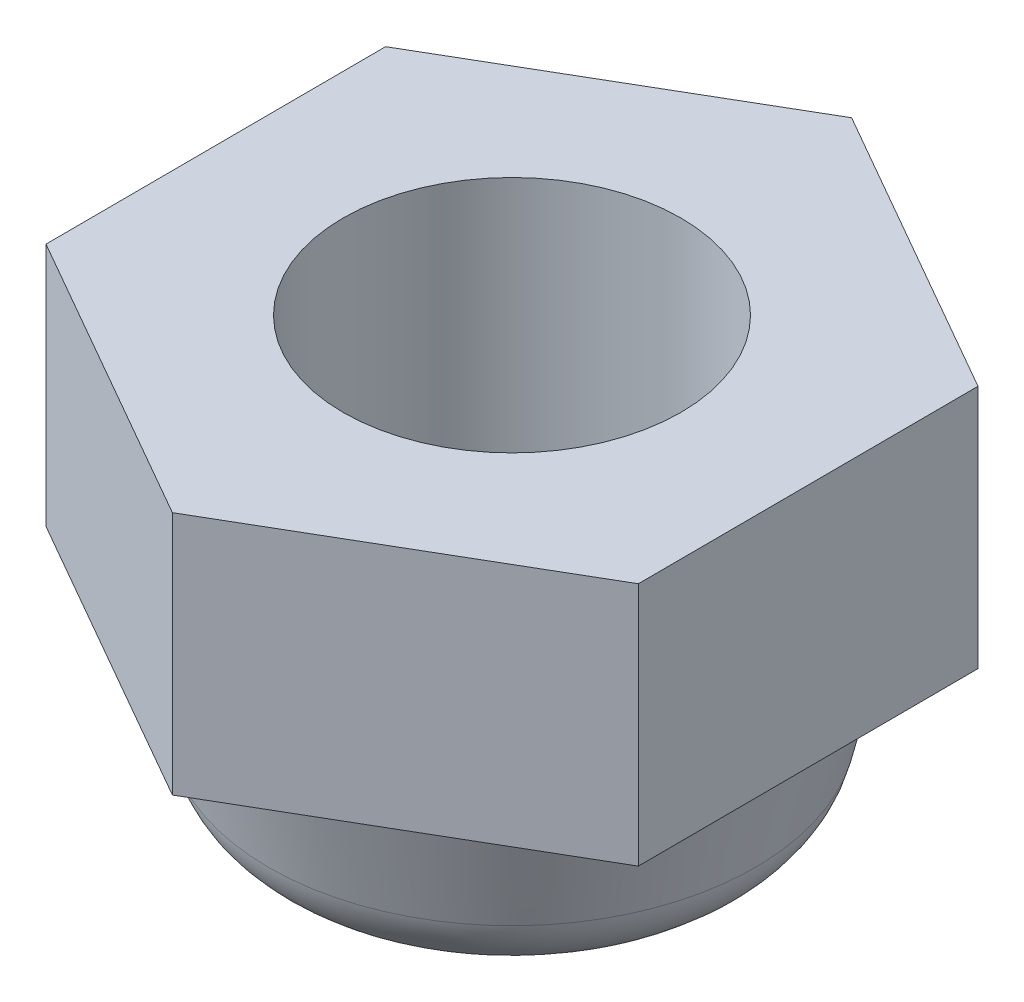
ISO-10303-21;
HEADER;
FILE_DESCRIPTION(('STEP AP214'),'2;1');
FILE_NAME('part.step','',(''),(''),'','','');
FILE_SCHEMA(('AUTOMOTIVE_DESIGN { 1 0 10303 214 1 1 1 1 }'));
ENDSEC;
DATA;
#1=APPLICATION_CONTEXT('core data for automotive mechanical design processes');
#2=APPLICATION_PROTOCOL_DEFINITION('international standard','automotive_design',2000,#1);
#3=PRODUCT_CONTEXT('',#1,'mechanical');
#4=PRODUCT('Part','Part','',(#3));
#5=PRODUCT_RELATED_PRODUCT_CATEGORY('part','',(#4));
#6=PRODUCT_DEFINITION_FORMATION('','',#4);
#7=PRODUCT_DEFINITION_CONTEXT('part definition',#1,'design');
#8=PRODUCT_DEFINITION('design','',#6,#7);
#9=PRODUCT_DEFINITION_SHAPE('','',#8);
#10=(LENGTH_UNIT() NAMED_UNIT(*) SI_UNIT(.MILLI.,.METRE.));
#11=(NAMED_UNIT(*) PLANE_ANGLE_UNIT() SI_UNIT($,.RADIAN.));
#12=(NAMED_UNIT(*) SI_UNIT($,.STERADIAN.) SOLID_ANGLE_UNIT());
#13=UNCERTAINTY_MEASURE_WITH_UNIT(LENGTH_MEASURE(1.E-05),#10,'distance_accuracy_value','');
#14=(GEOMETRIC_REPRESENTATION_CONTEXT(3) GLOBAL_UNCERTAINTY_ASSIGNED_CONTEXT((#13)) GLOBAL_UNIT_ASSIGNED_CONTEXT((#10,
#11,#12)) REPRESENTATION_CONTEXT('',''));
#15=CARTESIAN_POINT('',(0.,0.,0.));
#16=DIRECTION('',(0.,0.,1.));
#17=DIRECTION('',(1.,0.,0.));
#18=AXIS2_PLACEMENT_3D('',#15,#16,#17);
#19=CARTESIAN_POINT('',(3.49279421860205,0.,-2.03315564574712));
#20=DIRECTION('',(0.,1.,0.));
#21=DIRECTION('',(0.,0.,1.));
#22=AXIS2_PLACEMENT_3D('',#19,#20,#21);
#23=PLANE('',#22);
#24=DIRECTION('',(-0.86424243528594,0.,0.503075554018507));
#25=VECTOR('',#24,1.);
#26=CARTESIAN_POINT('',(0.0143673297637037,0.,4.04142634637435));
#27=LINE('',#26,#25);
#28=CARTESIAN_POINT('',(3.5071615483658,0.,2.00827070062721));
#29=VERTEX_POINT('',#28);
#30=CARTESIAN_POINT('',(0.0143673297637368,0.,4.04142634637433));
#31=VERTEX_POINT('',#30);
#32=EDGE_CURVE('E153',#29,#31,#27,.T.);
#33=ORIENTED_EDGE('',*,*,#32,.T.);
#34=DIRECTION('',(-0.867797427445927,0.,-0.4969181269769));
#35=VECTOR('',#34,1.);
#36=CARTESIAN_POINT('',(-3.49279421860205,0.,2.0331556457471));
#37=LINE('',#36,#35);
#38=CARTESIAN_POINT('',(-3.49279421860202,0.,2.0331556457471));
#39=VERTEX_POINT('',#38);
#40=EDGE_CURVE('E145',#31,#39,#37,.T.);
#41=ORIENTED_EDGE('',*,*,#40,.T.);
#42=DIRECTION('',(-0.00355499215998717,0.,-0.999993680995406));
#43=VECTOR('',#42,1.);
#44=CARTESIAN_POINT('',(-3.50716154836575,0.,-2.00827070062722));
#45=LINE('',#44,#43);
#46=CARTESIAN_POINT('',(-3.50716154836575,0.,-2.00827070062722));
#47=VERTEX_POINT('',#46);
#48=EDGE_CURVE('E139',#39,#47,#45,.T.);
#49=ORIENTED_EDGE('',*,*,#48,.T.);
#50=DIRECTION('',(0.86424243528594,0.,-0.503075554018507));
#51=VECTOR('',#50,1.);
#52=CARTESIAN_POINT('',(-0.0143673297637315,0.,-4.04142634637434));
#53=LINE('',#52,#51);
#54=CARTESIAN_POINT('',(-0.0143673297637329,0.,-4.04142634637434));
#55=VERTEX_POINT('',#54);
#56=EDGE_CURVE('E133',#47,#55,#53,.T.);
#57=ORIENTED_EDGE('',*,*,#56,.T.);
#58=DIRECTION('',(0.867797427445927,0.,0.4969181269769));
#59=VECTOR('',#58,1.);
#60=CARTESIAN_POINT('',(3.49279421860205,0.,-2.03315564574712));
#61=LINE('',#60,#59);
#62=CARTESIAN_POINT('',(3.49279421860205,0.,-2.03315564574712));
#63=VERTEX_POINT('',#62);
#64=EDGE_CURVE('E127',#55,#63,#61,.T.);
#65=ORIENTED_EDGE('',*,*,#64,.T.);
#66=DIRECTION('',(0.00355499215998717,0.,0.999993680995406));
#67=VECTOR('',#66,1.);
#68=CARTESIAN_POINT('',(3.50716154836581,0.,2.00827070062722));
#69=LINE('',#68,#67);
#70=EDGE_CURVE('E85',#63,#29,#69,.T.);
#71=ORIENTED_EDGE('',*,*,#70,.T.);
#72=EDGE_LOOP('',(#33,#41,#49,#57,#65,#71));
#73=FACE_BOUND('',#72,.T.);
#74=CARTESIAN_POINT('',(0.,0.,0.));
#75=DIRECTION('',(0.,-1.,0.));
#76=DIRECTION('',(0.,0.,1.));
#77=AXIS2_PLACEMENT_3D('',#74,#75,#76);
#78=CIRCLE('',#77,3.35797174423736);
#79=CARTESIAN_POINT('',(0.,0.,-3.35797174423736));
#80=VERTEX_POINT('',#79);
#81=CARTESIAN_POINT('',(0.,0.,3.35797174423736));
#82=VERTEX_POINT('',#81);
#83=EDGE_CURVE('E81',#80,#82,#78,.F.);
#84=ORIENTED_EDGE('',*,*,#83,.T.);
#85=CARTESIAN_POINT('',(0.,0.,0.));
#86=DIRECTION('',(0.,-1.,0.));
#87=DIRECTION('',(0.,0.,-1.));
#88=AXIS2_PLACEMENT_3D('',#85,#86,#87);
#89=CIRCLE('',#88,3.35797174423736);
#90=EDGE_CURVE('E75',#80,#82,#89,.T.);
#91=ORIENTED_EDGE('',*,*,#90,.F.);
#92=EDGE_LOOP('',(#84,#91));
#93=FACE_BOUND('',#92,.T.);
#94=ADVANCED_FACE('F17',(#73,#93),#23,.F.);
#95=CARTESIAN_POINT('',(0.,-0.2,0.));
#96=DIRECTION('',(0.,1.,0.));
#97=DIRECTION('',(0.,0.,1.));
#98=AXIS2_PLACEMENT_3D('',#95,#96,#97);
#99=TOROIDAL_SURFACE('',#98,3.35797174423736,0.2);
#100=ORIENTED_EDGE('',*,*,#90,.T.);
#101=ORIENTED_EDGE('',*,*,#83,.F.);
#102=EDGE_LOOP('',(#100,#101));
#103=FACE_BOUND('',#102,.T.);
#104=CARTESIAN_POINT('',(0.,-0.153675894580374,0.));
#105=DIRECTION('',(0.,1.,0.));
#106=DIRECTION('',(0.,0.,1.));
#107=AXIS2_PLACEMENT_3D('',#104,#105,#106);
#108=CIRCLE('',#107,3.1634105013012);
#109=CARTESIAN_POINT('',(0.,-0.153675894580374,3.1634105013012));
#110=VERTEX_POINT('',#109);
#111=EDGE_CURVE('E109',#110,#110,#108,.F.);
#112=ORIENTED_EDGE('',*,*,#111,.F.);
#113=EDGE_LOOP('',(#112));
#114=FACE_BOUND('',#113,.T.);
#115=ADVANCED_FACE('F79',(#103,#114),#99,.F.);
#116=CARTESIAN_POINT('',(3.50716154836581,2.9,2.00827070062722));
#117=DIRECTION('',(-0.999993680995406,0.,0.00355499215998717));
#118=DIRECTION('',(0.00355499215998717,0.,0.999993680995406));
#119=AXIS2_PLACEMENT_3D('',#116,#117,#118);
#120=PLANE('',#119);
#121=DIRECTION('',(0.,1.,0.));
#122=VECTOR('',#121,1.);
#123=CARTESIAN_POINT('',(3.49279421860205,2.9,-2.03315564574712));
#124=LINE('',#123,#122);
#125=CARTESIAN_POINT('',(3.49279421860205,2.9,-2.03315564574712));
#126=VERTEX_POINT('',#125);
#127=EDGE_CURVE('E124',#63,#126,#124,.T.);
#128=ORIENTED_EDGE('',*,*,#127,.T.);
#129=DIRECTION('',(-0.00355499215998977,0.,-0.999993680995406));
#130=VECTOR('',#129,1.);
#131=CARTESIAN_POINT('',(3.50716154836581,2.9,2.00827070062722));
#132=LINE('',#131,#130);
#133=CARTESIAN_POINT('',(3.5071615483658,2.9,2.00827070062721));
#134=VERTEX_POINT('',#133);
#135=EDGE_CURVE('E156',#134,#126,#132,.T.);
#136=ORIENTED_EDGE('',*,*,#135,.F.);
#137=DIRECTION('',(0.,1.,0.));
#138=VECTOR('',#137,1.);
#139=CARTESIAN_POINT('',(3.50716154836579,2.9,2.00827070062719));
#140=LINE('',#139,#138);
#141=EDGE_CURVE('E150',#134,#29,#140,.F.);
#142=ORIENTED_EDGE('',*,*,#141,.T.);
#143=ORIENTED_EDGE('',*,*,#70,.F.);
#144=EDGE_LOOP('',(#128,#136,#142,#143));
#145=FACE_BOUND('',#144,.T.);
#146=ADVANCED_FACE('F118',(#145),#120,.F.);
#147=CARTESIAN_POINT('',(3.49279421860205,2.9,-2.03315564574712));
#148=DIRECTION('',(-0.4969181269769,0.,0.867797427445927));
#149=DIRECTION('',(0.867797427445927,0.,0.4969181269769));
#150=AXIS2_PLACEMENT_3D('',#147,#148,#149);
#151=PLANE('',#150);
#152=DIRECTION('',(0.,1.,0.));
#153=VECTOR('',#152,1.);
#154=CARTESIAN_POINT('',(-0.0143673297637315,2.9,-4.04142634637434));
#155=LINE('',#154,#153);
#156=CARTESIAN_POINT('',(-0.0143673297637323,2.9,-4.04142634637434));
#157=VERTEX_POINT('',#156);
#158=EDGE_CURVE('E130',#55,#157,#155,.T.);
#159=ORIENTED_EDGE('',*,*,#158,.T.);
#160=DIRECTION('',(-0.867797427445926,0.,-0.496918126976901));
#161=VECTOR('',#160,1.);
#162=CARTESIAN_POINT('',(3.49279421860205,2.9,-2.03315564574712));
#163=LINE('',#162,#161);
#164=EDGE_CURVE('E158',#126,#157,#163,.T.);
#165=ORIENTED_EDGE('',*,*,#164,.F.);
#166=ORIENTED_EDGE('',*,*,#127,.F.);
#167=ORIENTED_EDGE('',*,*,#64,.F.);
#168=EDGE_LOOP('',(#159,#165,#166,#167));
#169=FACE_BOUND('',#168,.T.);
#170=ADVANCED_FACE('F196',(#169),#151,.F.);
#171=CARTESIAN_POINT('',(-0.0143673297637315,2.9,-4.04142634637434));
#172=DIRECTION('',(0.503075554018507,0.,0.86424243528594));
#173=DIRECTION('',(0.86424243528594,0.,-0.503075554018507));
#174=AXIS2_PLACEMENT_3D('',#171,#172,#173);
#175=PLANE('',#174);
#176=DIRECTION('',(0.,1.,0.));
#177=VECTOR('',#176,1.);
#178=CARTESIAN_POINT('',(-3.50716154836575,2.9,-2.00827070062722));
#179=LINE('',#178,#177);
#180=CARTESIAN_POINT('',(-3.50716154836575,2.9,-2.00827070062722));
#181=VERTEX_POINT('',#180);
#182=EDGE_CURVE('E136',#47,#181,#179,.T.);
#183=ORIENTED_EDGE('',*,*,#182,.T.);
#184=DIRECTION('',(-0.86424243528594,0.,0.503075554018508));
#185=VECTOR('',#184,1.);
#186=CARTESIAN_POINT('',(-0.0143673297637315,2.9,-4.04142634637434));
#187=LINE('',#186,#185);
#188=EDGE_CURVE('E160',#157,#181,#187,.T.);
#189=ORIENTED_EDGE('',*,*,#188,.F.);
#190=ORIENTED_EDGE('',*,*,#158,.F.);
#191=ORIENTED_EDGE('',*,*,#56,.F.);
#192=EDGE_LOOP('',(#183,#189,#190,#191));
#193=FACE_BOUND('',#192,.T.);
#194=ADVANCED_FACE('F193',(#193),#175,.F.);
#195=CARTESIAN_POINT('',(-3.50716154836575,2.9,-2.00827070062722));
#196=DIRECTION('',(0.999993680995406,0.,-0.00355499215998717));
#197=DIRECTION('',(-0.00355499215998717,0.,-0.999993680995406));
#198=AXIS2_PLACEMENT_3D('',#195,#196,#197);
#199=PLANE('',#198);
#200=DIRECTION('',(0.,1.,0.));
#201=VECTOR('',#200,1.);
#202=CARTESIAN_POINT('',(-3.49279421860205,2.9,2.0331556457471));
#203=LINE('',#202,#201);
#204=CARTESIAN_POINT('',(-3.49279421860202,2.9,2.0331556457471));
#205=VERTEX_POINT('',#204);
#206=EDGE_CURVE('E142',#39,#205,#203,.T.);
#207=ORIENTED_EDGE('',*,*,#206,.T.);
#208=DIRECTION('',(0.00355499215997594,0.,0.999993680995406));
#209=VECTOR('',#208,1.);
#210=CARTESIAN_POINT('',(-3.50716154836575,2.9,-2.00827070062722));
#211=LINE('',#210,#209);
#212=EDGE_CURVE('E162',#181,#205,#211,.T.);
#213=ORIENTED_EDGE('',*,*,#212,.F.);
#214=ORIENTED_EDGE('',*,*,#182,.F.);
#215=ORIENTED_EDGE('',*,*,#48,.F.);
#216=EDGE_LOOP('',(#207,#213,#214,#215));
#217=FACE_BOUND('',#216,.T.);
#218=ADVANCED_FACE('F189',(#217),#199,.F.);
#219=CARTESIAN_POINT('',(-3.49279421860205,2.9,2.0331556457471));
#220=DIRECTION('',(0.4969181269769,0.,-0.867797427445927));
#221=DIRECTION('',(-0.867797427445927,0.,-0.4969181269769));
#222=AXIS2_PLACEMENT_3D('',#219,#220,#221);
#223=PLANE('',#222);
#224=DIRECTION('',(0.,1.,0.));
#225=VECTOR('',#224,1.);
#226=CARTESIAN_POINT('',(0.0143673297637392,2.9,4.04142634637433));
#227=LINE('',#226,#225);
#228=CARTESIAN_POINT('',(0.014367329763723,2.9,4.04142634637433));
#229=VERTEX_POINT('',#228);
#230=EDGE_CURVE('E148',#31,#229,#227,.T.);
#231=ORIENTED_EDGE('',*,*,#230,.T.);
#232=DIRECTION('',(0.867797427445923,0.,0.496918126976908));
#233=VECTOR('',#232,1.);
#234=CARTESIAN_POINT('',(-3.49279421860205,2.9,2.0331556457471));
#235=LINE('',#234,#233);
#236=EDGE_CURVE('E37',#205,#229,#235,.T.);
#237=ORIENTED_EDGE('',*,*,#236,.F.);
#238=ORIENTED_EDGE('',*,*,#206,.F.);
#239=ORIENTED_EDGE('',*,*,#40,.F.);
#240=EDGE_LOOP('',(#231,#237,#238,#239));
#241=FACE_BOUND('',#240,.T.);
#242=ADVANCED_FACE('F185',(#241),#223,.F.);
#243=CARTESIAN_POINT('',(0.0143673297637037,2.9,4.04142634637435));
#244=DIRECTION('',(-0.503075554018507,0.,-0.86424243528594));
#245=DIRECTION('',(-0.86424243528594,0.,0.503075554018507));
#246=AXIS2_PLACEMENT_3D('',#243,#244,#245);
#247=PLANE('',#246);
#248=ORIENTED_EDGE('',*,*,#141,.F.);
#249=DIRECTION('',(0.864242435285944,0.,-0.5030755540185));
#250=VECTOR('',#249,1.);
#251=CARTESIAN_POINT('',(0.0143673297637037,2.9,4.04142634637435));
#252=LINE('',#251,#250);
#253=EDGE_CURVE('E165',#229,#134,#252,.T.);
#254=ORIENTED_EDGE('',*,*,#253,.F.);
#255=ORIENTED_EDGE('',*,*,#230,.F.);
#256=ORIENTED_EDGE('',*,*,#32,.F.);
#257=EDGE_LOOP('',(#248,#254,#255,#256));
#258=FACE_BOUND('',#257,.T.);
#259=ADVANCED_FACE('F181',(#258),#247,.F.);
#260=CARTESIAN_POINT('',(0.,-0.153675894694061,0.));
#261=DIRECTION('',(0.,1.,0.));
#262=DIRECTION('',(0.,0.,1.));
#263=AXIS2_PLACEMENT_3D('',#260,#261,#262);
#264=CONICAL_SURFACE('',#263,3.16341050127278,0.23374318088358);
#265=ORIENTED_EDGE('',*,*,#111,.T.);
#266=EDGE_LOOP('',(#265));
#267=FACE_BOUND('',#266,.T.);
#268=CARTESIAN_POINT('',(0.,-1.33162052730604,0.));
#269=DIRECTION('',(0.,-1.,0.));
#270=DIRECTION('',(0.,0.,-1.));
#271=AXIS2_PLACEMENT_3D('',#268,#269,#270);
#272=CIRCLE('',#271,2.88294749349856);
#273=CARTESIAN_POINT('',(0.,-1.33162052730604,-2.88294749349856));
#274=VERTEX_POINT('',#273);
#275=EDGE_CURVE('E88',#274,#274,#272,.T.);
#276=ORIENTED_EDGE('',*,*,#275,.F.);
#277=EDGE_LOOP('',(#276));
#278=FACE_BOUND('',#277,.T.);
#279=ADVANCED_FACE('F178',(#267,#278),#264,.T.);
#280=CARTESIAN_POINT('',(3.49279421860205,2.9,-2.03315564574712));
#281=DIRECTION('',(0.,1.,0.));
#282=DIRECTION('',(0.,0.,1.));
#283=AXIS2_PLACEMENT_3D('',#280,#281,#282);
#284=PLANE('',#283);
#285=ORIENTED_EDGE('',*,*,#236,.T.);
#286=ORIENTED_EDGE('',*,*,#253,.T.);
#287=ORIENTED_EDGE('',*,*,#135,.T.);
#288=ORIENTED_EDGE('',*,*,#164,.T.);
#289=ORIENTED_EDGE('',*,*,#188,.T.);
#290=ORIENTED_EDGE('',*,*,#212,.T.);
#291=EDGE_LOOP('',(#285,#286,#287,#288,#289,#290));
#292=FACE_BOUND('',#291,.T.);
#293=CARTESIAN_POINT('',(0.,2.9,0.));
#294=DIRECTION('',(0.,1.,0.));
#295=DIRECTION('',(0.,0.,1.));
#296=AXIS2_PLACEMENT_3D('',#293,#294,#295);
#297=CIRCLE('',#296,2.);
#298=CARTESIAN_POINT('',(0.,2.9,2.));
#299=VERTEX_POINT('',#298);
#300=EDGE_CURVE('E28',#299,#299,#297,.F.);
#301=ORIENTED_EDGE('',*,*,#300,.T.);
#302=EDGE_LOOP('',(#301));
#303=FACE_BOUND('',#302,.T.);
#304=ADVANCED_FACE('F174',(#292,#303),#284,.T.);
#305=CARTESIAN_POINT('',(0.,-1.1,0.));
#306=DIRECTION('',(0.,-1.,0.));
#307=DIRECTION('',(0.,0.,-1.));
#308=AXIS2_PLACEMENT_3D('',#305,#306,#307);
#309=TOROIDAL_SURFACE('',#308,1.9101412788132,1.);
#310=CARTESIAN_POINT('',(0.,-2.09595452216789,0.));
#311=DIRECTION('',(0.,1.,0.));
#312=DIRECTION('',(0.,0.,1.));
#313=AXIS2_PLACEMENT_3D('',#310,#311,#312);
#314=CIRCLE('',#313,2.);
#315=CARTESIAN_POINT('',(0.,-2.09595452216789,2.));
#316=VERTEX_POINT('',#315);
#317=EDGE_CURVE('E11',#316,#316,#314,.T.);
#318=ORIENTED_EDGE('',*,*,#317,.T.);
#319=EDGE_LOOP('',(#318));
#320=FACE_BOUND('',#319,.T.);
#321=ORIENTED_EDGE('',*,*,#275,.T.);
#322=EDGE_LOOP('',(#321));
#323=FACE_BOUND('',#322,.T.);
#324=ADVANCED_FACE('F169',(#320,#323),#309,.T.);
#325=CARTESIAN_POINT('',(0.,-2.1,0.));
#326=DIRECTION('',(0.,1.,0.));
#327=DIRECTION('',(0.,0.,1.));
#328=AXIS2_PLACEMENT_3D('',#325,#326,#327);
#329=CYLINDRICAL_SURFACE('',#328,2.);
#330=ORIENTED_EDGE('',*,*,#300,.F.);
#331=EDGE_LOOP('',(#330));
#332=FACE_BOUND('',#331,.T.);
#333=ORIENTED_EDGE('',*,*,#317,.F.);
#334=EDGE_LOOP('',(#333));
#335=FACE_BOUND('',#334,.T.);
#336=ADVANCED_FACE('F173',(#332,#335),#329,.F.);
#337=CLOSED_SHELL('',(#94,#115,#146,#170,#194,#218,#242,#259,#279,#304,#324,#336));
#338=MANIFOLD_SOLID_BREP('B1',#337);
#339=ADVANCED_BREP_SHAPE_REPRESENTATION('',(#18,#338),#14);
#340=SHAPE_DEFINITION_REPRESENTATION(#9,#339);
ENDSEC;
END-ISO-10303-21;
